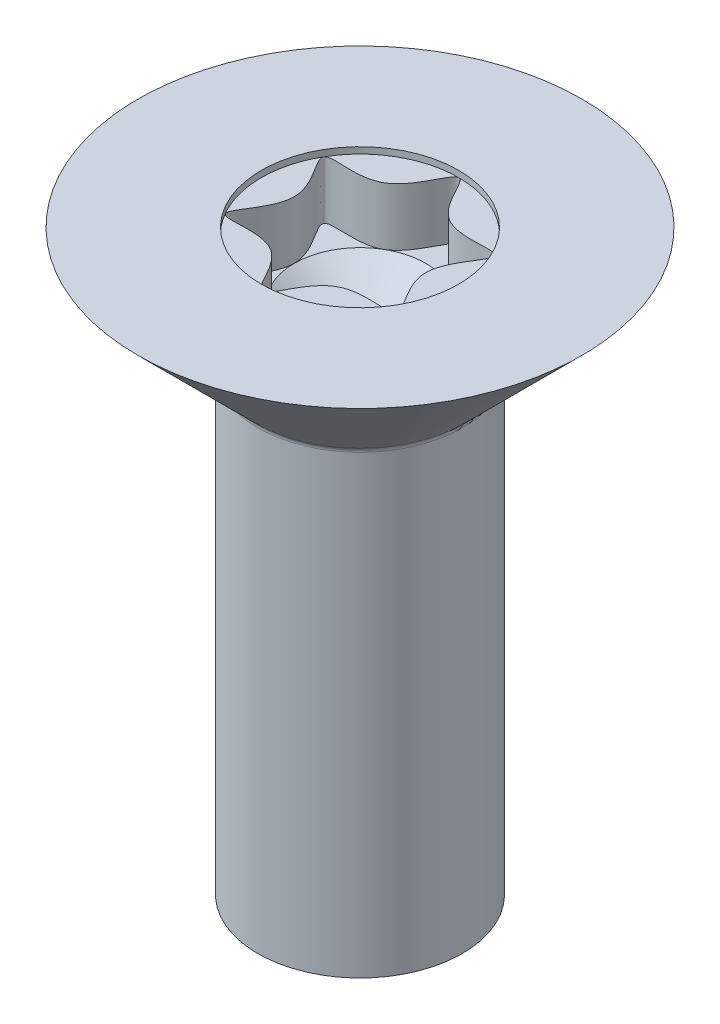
from build123d import *

# Parameters (mm, degrees)
RECESS_CUT_EXTRUDE1_DEPTH = 0.91
SKETCH3_R                 = 1.4
RECESS_CUT_EXTRUDE2_DEPTH = 0.091
FILLET1_R                 = 0.1


with BuildPart() as part:
    # Sketch1 → Body-Revolve (revolve)
    with BuildSketch(Plane.XY, mode=Mode.PRIVATE) as body_revolve_sk:
        Polygon((0, 8.2), (3.15, 8.2), (1.45, 6.5), (1.45, 0), (0, 0), align=None)
    revolve(body_revolve_sk.sketch.rotate(Axis((0, 0, 0), (0, 1, 0)), 90), axis=Axis((0, 0, 0), (0, 1, 0)))

    # Sketch2 → Recess-Cut-Extrude1 (cut)
    with BuildSketch(Plane(origin=(0, 8.2, 0), x_dir=(-1, 0, 0), z_dir=(0, 1, 0))):
        with BuildLine():
            add(Edge.make_bspline(
                [(0, -1.4), (-0.100650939, -1.4), (-0.301952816, -0.522997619), (-1.592188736, -0.919250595), (-0.603905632, 0), (-1.592188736, 0.919250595), (-0.301952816, 0.522997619), (0, 1.838501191), (0.301952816, 0.522997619), (1.592188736, 0.919250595), (0.603905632, 0), (1.592188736, -0.919250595), (0.301952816, -0.522997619), (0.100650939, -1.4), (0, -1.4)],
                knots=[0, 0, 0, 0, 0.083333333, 0.166666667, 0.25, 0.333333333, 0.416666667, 0.5, 0.583333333, 0.666666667, 0.75, 0.833333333, 0.916666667, 1, 1, 1, 1], degree=3))
        make_face()
    extrude(amount=-RECESS_CUT_EXTRUDE1_DEPTH, mode=Mode.SUBTRACT)

    # Sketch3 → Recess-Cut-Extrude2 (cut)
    with BuildSketch(Plane(origin=(0, 8.2, 0), x_dir=(-1, 0, 0), z_dir=(0, 1, 0))):
        with Locations(Location((0, 0, 0), (0, 0, 90))):
            Circle(SKETCH3_R)
    extrude(amount=-RECESS_CUT_EXTRUDE2_DEPTH, mode=Mode.SUBTRACT)

    # Sketch4 → Drill-Cut-Revolve (revolve, cut)
    with BuildSketch(Plane.XY, mode=Mode.PRIVATE) as drill_cut_revolve_sk:
        Polygon((0, 7.29), (0.933333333, 7.29), (0, 6.67), align=None)
    revolve(drill_cut_revolve_sk.sketch.rotate(Axis((0, 0, 0), (0, 1, 0)), 270), axis=Axis((0, 0, 0), (0, 1, 0)), mode=Mode.SUBTRACT)

    # Fillet1
    fillet1_edges = [part.edges().sort_by_distance(p)[0] for p in [
        (0, 6.5, 1.45),
    ]]
    fillet(fillet1_edges, radius=FILLET1_R)


solid = part.part
